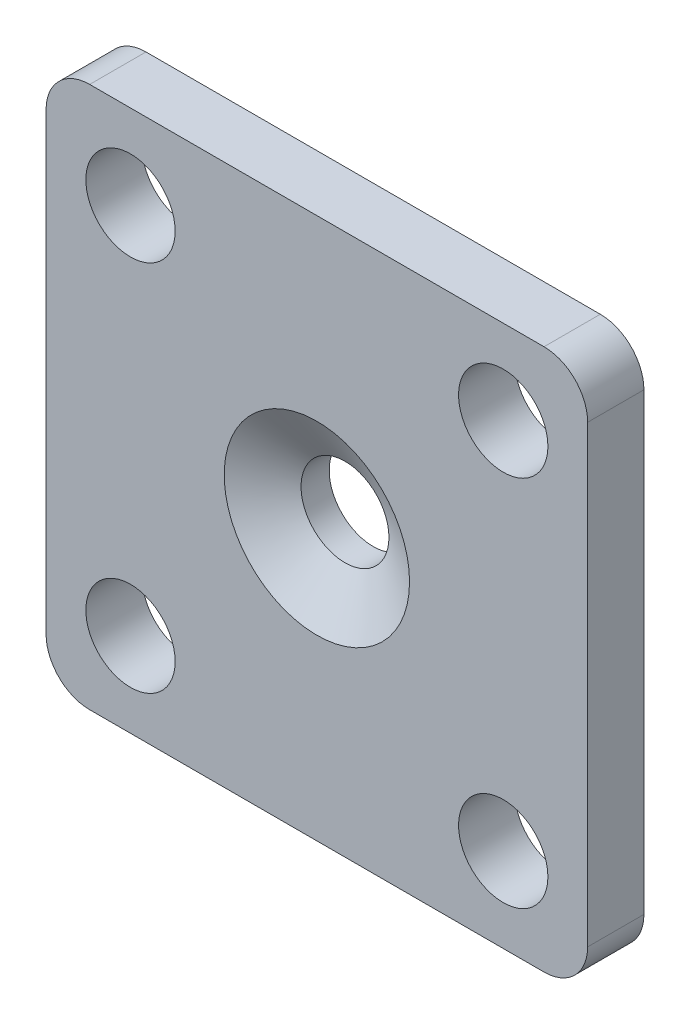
ISO-10303-21;
HEADER;
FILE_DESCRIPTION(('STEP AP214'),'2;1');
FILE_NAME('part.step','',(''),(''),'','','');
FILE_SCHEMA(('AUTOMOTIVE_DESIGN { 1 0 10303 214 1 1 1 1 }'));
ENDSEC;
DATA;
#1=APPLICATION_CONTEXT('core data for automotive mechanical design processes');
#2=APPLICATION_PROTOCOL_DEFINITION('international standard','automotive_design',2000,#1);
#3=PRODUCT_CONTEXT('',#1,'mechanical');
#4=PRODUCT('Part','Part','',(#3));
#5=PRODUCT_RELATED_PRODUCT_CATEGORY('part','',(#4));
#6=PRODUCT_DEFINITION_FORMATION('','',#4);
#7=PRODUCT_DEFINITION_CONTEXT('part definition',#1,'design');
#8=PRODUCT_DEFINITION('design','',#6,#7);
#9=PRODUCT_DEFINITION_SHAPE('','',#8);
#10=(LENGTH_UNIT() NAMED_UNIT(*) SI_UNIT(.MILLI.,.METRE.));
#11=(NAMED_UNIT(*) PLANE_ANGLE_UNIT() SI_UNIT($,.RADIAN.));
#12=(NAMED_UNIT(*) SI_UNIT($,.STERADIAN.) SOLID_ANGLE_UNIT());
#13=UNCERTAINTY_MEASURE_WITH_UNIT(LENGTH_MEASURE(1.E-05),#10,'distance_accuracy_value','');
#14=(GEOMETRIC_REPRESENTATION_CONTEXT(3) GLOBAL_UNCERTAINTY_ASSIGNED_CONTEXT((#13)) GLOBAL_UNIT_ASSIGNED_CONTEXT((#10,
#11,#12)) REPRESENTATION_CONTEXT('',''));
#15=CARTESIAN_POINT('',(0.,0.,0.));
#16=DIRECTION('',(0.,0.,1.));
#17=DIRECTION('',(1.,0.,0.));
#18=AXIS2_PLACEMENT_3D('',#15,#16,#17);
#19=CARTESIAN_POINT('',(4.8895,-4.8895,0.));
#20=DIRECTION('',(0.,0.,1.));
#21=DIRECTION('',(1.,0.,0.));
#22=AXIS2_PLACEMENT_3D('',#19,#20,#21);
#23=PLANE('',#22);
#24=CARTESIAN_POINT('',(0.,0.,0.));
#25=DIRECTION('',(0.,0.,-1.));
#26=DIRECTION('',(-1.,0.,0.));
#27=AXIS2_PLACEMENT_3D('',#24,#25,#26);
#28=CIRCLE('',#27,1.6002);
#29=CARTESIAN_POINT('',(-1.6002,0.,0.));
#30=VERTEX_POINT('',#29);
#31=EDGE_CURVE('E218',#30,#30,#28,.T.);
#32=ORIENTED_EDGE('',*,*,#31,.F.);
#33=EDGE_LOOP('',(#32));
#34=FACE_BOUND('',#33,.T.);
#35=CARTESIAN_POINT('',(0.,0.,0.));
#36=DIRECTION('',(0.,0.,-1.));
#37=DIRECTION('',(-1.,0.,0.));
#38=AXIS2_PLACEMENT_3D('',#35,#36,#37);
#39=CIRCLE('',#38,3.1496);
#40=CARTESIAN_POINT('',(-3.1496,0.,0.));
#41=VERTEX_POINT('',#40);
#42=EDGE_CURVE('E234',#41,#41,#39,.T.);
#43=ORIENTED_EDGE('',*,*,#42,.T.);
#44=EDGE_LOOP('',(#43));
#45=FACE_BOUND('',#44,.T.);
#46=ADVANCED_FACE('F41',(#34,#45),#23,.F.);
#47=CARTESIAN_POINT('',(0.,0.,0.));
#48=DIRECTION('',(0.,0.,1.));
#49=DIRECTION('',(1.,0.,0.));
#50=AXIS2_PLACEMENT_3D('',#47,#48,#49);
#51=CIRCLE('',#50,0.793749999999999);
#52=CARTESIAN_POINT('',(0.793750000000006,0.,0.));
#53=VERTEX_POINT('',#52);
#54=EDGE_CURVE('E135',#53,#53,#51,.T.);
#55=ORIENTED_EDGE('',*,*,#54,.T.);
#56=EDGE_LOOP('',(#55));
#57=FACE_BOUND('',#56,.T.);
#58=CARTESIAN_POINT('',(0.,0.,0.));
#59=DIRECTION('',(0.,0.,-1.));
#60=DIRECTION('',(-1.,0.,0.));
#61=AXIS2_PLACEMENT_3D('',#58,#59,#60);
#62=CIRCLE('',#61,0.9398);
#63=CARTESIAN_POINT('',(-0.9398,0.,0.));
#64=VERTEX_POINT('',#63);
#65=EDGE_CURVE('E222',#64,#64,#62,.T.);
#66=ORIENTED_EDGE('',*,*,#65,.T.);
#67=EDGE_LOOP('',(#66));
#68=FACE_BOUND('',#67,.T.);
#69=ADVANCED_FACE('F261',(#57,#68),#23,.F.);
#70=CARTESIAN_POINT('',(4.8895,-4.8895,1.016));
#71=DIRECTION('',(0.,0.,1.));
#72=DIRECTION('',(1.,0.,0.));
#73=AXIS2_PLACEMENT_3D('',#70,#71,#72);
#74=PLANE('',#73);
#75=CARTESIAN_POINT('',(0.,0.,1.016));
#76=DIRECTION('',(0.,0.,1.));
#77=DIRECTION('',(1.,0.,0.));
#78=AXIS2_PLACEMENT_3D('',#75,#76,#77);
#79=CIRCLE('',#78,1.67363181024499);
#80=CARTESIAN_POINT('',(1.673631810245,0.,1.016));
#81=VERTEX_POINT('',#80);
#82=EDGE_CURVE('E153',#81,#81,#79,.F.);
#83=ORIENTED_EDGE('',*,*,#82,.T.);
#84=EDGE_LOOP('',(#83));
#85=FACE_BOUND('',#84,.T.);
#86=CARTESIAN_POINT('',(3.36549999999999,-3.36549999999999,1.016));
#87=DIRECTION('',(0.,0.,1.));
#88=DIRECTION('',(1.,0.,0.));
#89=AXIS2_PLACEMENT_3D('',#86,#87,#88);
#90=CIRCLE('',#89,0.80645);
#91=CARTESIAN_POINT('',(4.17194999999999,-3.36549999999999,1.016));
#92=VERTEX_POINT('',#91);
#93=EDGE_CURVE('E203',#92,#92,#90,.T.);
#94=ORIENTED_EDGE('',*,*,#93,.F.);
#95=EDGE_LOOP('',(#94));
#96=FACE_BOUND('',#95,.T.);
#97=CARTESIAN_POINT('',(-3.36550000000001,3.36550000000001,1.016));
#98=DIRECTION('',(0.,0.,1.));
#99=DIRECTION('',(1.,0.,0.));
#100=AXIS2_PLACEMENT_3D('',#97,#98,#99);
#101=CIRCLE('',#100,0.806450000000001);
#102=CARTESIAN_POINT('',(-2.55905000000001,3.36550000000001,1.016));
#103=VERTEX_POINT('',#102);
#104=EDGE_CURVE('E141',#103,#103,#101,.T.);
#105=ORIENTED_EDGE('',*,*,#104,.F.);
#106=EDGE_LOOP('',(#105));
#107=FACE_BOUND('',#106,.T.);
#108=DIRECTION('',(1.,0.,0.));
#109=VECTOR('',#108,1.);
#110=CARTESIAN_POINT('',(-4.8895,-4.8895,1.016));
#111=LINE('',#110,#109);
#112=CARTESIAN_POINT('',(-4.1021,-4.8895,1.016));
#113=VERTEX_POINT('',#112);
#114=CARTESIAN_POINT('',(4.1021,-4.8895,1.016));
#115=VERTEX_POINT('',#114);
#116=EDGE_CURVE('E144',#113,#115,#111,.T.);
#117=ORIENTED_EDGE('',*,*,#116,.T.);
#118=CARTESIAN_POINT('',(4.1021,-4.1021,1.016));
#119=DIRECTION('',(0.,0.,1.));
#120=DIRECTION('',(1.,0.,0.));
#121=AXIS2_PLACEMENT_3D('',#118,#119,#120);
#122=CIRCLE('',#121,0.7874);
#123=CARTESIAN_POINT('',(4.8895,-4.1021,1.016));
#124=VERTEX_POINT('',#123);
#125=EDGE_CURVE('E169',#115,#124,#122,.T.);
#126=ORIENTED_EDGE('',*,*,#125,.T.);
#127=DIRECTION('',(0.,1.,0.));
#128=VECTOR('',#127,1.);
#129=CARTESIAN_POINT('',(4.8895,4.8895,1.016));
#130=LINE('',#129,#128);
#131=CARTESIAN_POINT('',(4.8895,4.1021,1.016));
#132=VERTEX_POINT('',#131);
#133=EDGE_CURVE('E127',#124,#132,#130,.T.);
#134=ORIENTED_EDGE('',*,*,#133,.T.);
#135=CARTESIAN_POINT('',(4.1021,4.1021,1.016));
#136=DIRECTION('',(0.,0.,1.));
#137=DIRECTION('',(1.,0.,0.));
#138=AXIS2_PLACEMENT_3D('',#135,#136,#137);
#139=CIRCLE('',#138,0.7874);
#140=CARTESIAN_POINT('',(4.1021,4.8895,1.016));
#141=VERTEX_POINT('',#140);
#142=EDGE_CURVE('E164',#132,#141,#139,.T.);
#143=ORIENTED_EDGE('',*,*,#142,.T.);
#144=DIRECTION('',(-1.,0.,0.));
#145=VECTOR('',#144,1.);
#146=CARTESIAN_POINT('',(-4.8895,4.8895,1.016));
#147=LINE('',#146,#145);
#148=CARTESIAN_POINT('',(-4.1021,4.8895,1.016));
#149=VERTEX_POINT('',#148);
#150=EDGE_CURVE('E180',#141,#149,#147,.T.);
#151=ORIENTED_EDGE('',*,*,#150,.T.);
#152=CARTESIAN_POINT('',(-4.1021,4.1021,1.016));
#153=DIRECTION('',(0.,0.,1.));
#154=DIRECTION('',(1.,0.,0.));
#155=AXIS2_PLACEMENT_3D('',#152,#153,#154);
#156=CIRCLE('',#155,0.7874);
#157=CARTESIAN_POINT('',(-4.8895,4.1021,1.016));
#158=VERTEX_POINT('',#157);
#159=EDGE_CURVE('E63',#149,#158,#156,.T.);
#160=ORIENTED_EDGE('',*,*,#159,.T.);
#161=DIRECTION('',(0.,-1.,0.));
#162=VECTOR('',#161,1.);
#163=CARTESIAN_POINT('',(-4.8895,4.8895,1.016));
#164=LINE('',#163,#162);
#165=CARTESIAN_POINT('',(-4.8895,-4.1021,1.016));
#166=VERTEX_POINT('',#165);
#167=EDGE_CURVE('E188',#158,#166,#164,.T.);
#168=ORIENTED_EDGE('',*,*,#167,.T.);
#169=CARTESIAN_POINT('',(-4.1021,-4.1021,1.016));
#170=DIRECTION('',(0.,0.,1.));
#171=DIRECTION('',(1.,0.,0.));
#172=AXIS2_PLACEMENT_3D('',#169,#170,#171);
#173=CIRCLE('',#172,0.7874);
#174=EDGE_CURVE('E167',#166,#113,#173,.T.);
#175=ORIENTED_EDGE('',*,*,#174,.T.);
#176=EDGE_LOOP('',(#117,#126,#134,#143,#151,#160,#168,#175));
#177=FACE_BOUND('',#176,.T.);
#178=CARTESIAN_POINT('',(3.36549999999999,3.36550000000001,1.016));
#179=DIRECTION('',(0.,0.,1.));
#180=DIRECTION('',(1.,0.,0.));
#181=AXIS2_PLACEMENT_3D('',#178,#179,#180);
#182=CIRCLE('',#181,0.80645);
#183=CARTESIAN_POINT('',(4.17194999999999,3.36550000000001,1.016));
#184=VERTEX_POINT('',#183);
#185=EDGE_CURVE('E197',#184,#184,#182,.T.);
#186=ORIENTED_EDGE('',*,*,#185,.F.);
#187=EDGE_LOOP('',(#186));
#188=FACE_BOUND('',#187,.T.);
#189=CARTESIAN_POINT('',(-3.36550000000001,-3.36549999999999,1.016));
#190=DIRECTION('',(0.,0.,1.));
#191=DIRECTION('',(1.,0.,0.));
#192=AXIS2_PLACEMENT_3D('',#189,#190,#191);
#193=CIRCLE('',#192,0.806450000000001);
#194=CARTESIAN_POINT('',(-2.55905000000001,-3.36549999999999,1.016));
#195=VERTEX_POINT('',#194);
#196=EDGE_CURVE('E209',#195,#195,#193,.T.);
#197=ORIENTED_EDGE('',*,*,#196,.F.);
#198=EDGE_LOOP('',(#197));
#199=FACE_BOUND('',#198,.T.);
#200=ADVANCED_FACE('F259',(#85,#96,#107,#177,#188,#199),#74,.T.);
#201=CARTESIAN_POINT('',(0.,0.,0.));
#202=DIRECTION('',(0.,0.,-1.));
#203=DIRECTION('',(-1.,0.,0.));
#204=AXIS2_PLACEMENT_3D('',#201,#202,#203);
#205=CIRCLE('',#204,3.7846);
#206=CARTESIAN_POINT('',(-3.7846,0.,0.));
#207=VERTEX_POINT('',#206);
#208=EDGE_CURVE('E230',#207,#207,#205,.T.);
#209=ORIENTED_EDGE('',*,*,#208,.F.);
#210=EDGE_LOOP('',(#209));
#211=FACE_BOUND('',#210,.T.);
#212=CARTESIAN_POINT('',(3.36549999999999,-3.36549999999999,0.));
#213=DIRECTION('',(0.,0.,1.));
#214=DIRECTION('',(1.,0.,0.));
#215=AXIS2_PLACEMENT_3D('',#212,#213,#214);
#216=CIRCLE('',#215,0.80645);
#217=CARTESIAN_POINT('',(4.17194999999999,-3.36549999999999,0.));
#218=VERTEX_POINT('',#217);
#219=EDGE_CURVE('E206',#218,#218,#216,.T.);
#220=ORIENTED_EDGE('',*,*,#219,.T.);
#221=EDGE_LOOP('',(#220));
#222=FACE_BOUND('',#221,.T.);
#223=CARTESIAN_POINT('',(-3.36550000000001,3.36550000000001,0.));
#224=DIRECTION('',(0.,0.,1.));
#225=DIRECTION('',(1.,0.,0.));
#226=AXIS2_PLACEMENT_3D('',#223,#224,#225);
#227=CIRCLE('',#226,0.806450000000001);
#228=CARTESIAN_POINT('',(-2.55905000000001,3.36550000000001,0.));
#229=VERTEX_POINT('',#228);
#230=EDGE_CURVE('E194',#229,#229,#227,.T.);
#231=ORIENTED_EDGE('',*,*,#230,.T.);
#232=EDGE_LOOP('',(#231));
#233=FACE_BOUND('',#232,.T.);
#234=DIRECTION('',(0.,1.,0.));
#235=VECTOR('',#234,1.);
#236=CARTESIAN_POINT('',(4.8895,4.8895,0.));
#237=LINE('',#236,#235);
#238=CARTESIAN_POINT('',(4.8895,-4.1021,0.));
#239=VERTEX_POINT('',#238);
#240=CARTESIAN_POINT('',(4.8895,4.1021,0.));
#241=VERTEX_POINT('',#240);
#242=EDGE_CURVE('E124',#239,#241,#237,.T.);
#243=ORIENTED_EDGE('',*,*,#242,.F.);
#244=CARTESIAN_POINT('',(4.1021,-4.1021,0.));
#245=DIRECTION('',(0.,0.,1.));
#246=DIRECTION('',(1.,0.,0.));
#247=AXIS2_PLACEMENT_3D('',#244,#245,#246);
#248=CIRCLE('',#247,0.7874);
#249=CARTESIAN_POINT('',(4.1021,-4.8895,0.));
#250=VERTEX_POINT('',#249);
#251=EDGE_CURVE('E107',#239,#250,#248,.F.);
#252=ORIENTED_EDGE('',*,*,#251,.T.);
#253=DIRECTION('',(1.,0.,0.));
#254=VECTOR('',#253,1.);
#255=CARTESIAN_POINT('',(-4.8895,-4.8895,0.));
#256=LINE('',#255,#254);
#257=CARTESIAN_POINT('',(-4.1021,-4.8895,0.));
#258=VERTEX_POINT('',#257);
#259=EDGE_CURVE('E148',#258,#250,#256,.T.);
#260=ORIENTED_EDGE('',*,*,#259,.F.);
#261=CARTESIAN_POINT('',(-4.1021,-4.1021,0.));
#262=DIRECTION('',(0.,0.,1.));
#263=DIRECTION('',(1.,0.,0.));
#264=AXIS2_PLACEMENT_3D('',#261,#262,#263);
#265=CIRCLE('',#264,0.7874);
#266=CARTESIAN_POINT('',(-4.8895,-4.1021,0.));
#267=VERTEX_POINT('',#266);
#268=EDGE_CURVE('E118',#258,#267,#265,.F.);
#269=ORIENTED_EDGE('',*,*,#268,.T.);
#270=DIRECTION('',(0.,-1.,0.));
#271=VECTOR('',#270,1.);
#272=CARTESIAN_POINT('',(-4.8895,4.8895,0.));
#273=LINE('',#272,#271);
#274=CARTESIAN_POINT('',(-4.8895,4.1021,0.));
#275=VERTEX_POINT('',#274);
#276=EDGE_CURVE('E138',#275,#267,#273,.T.);
#277=ORIENTED_EDGE('',*,*,#276,.F.);
#278=CARTESIAN_POINT('',(-4.1021,4.1021,0.));
#279=DIRECTION('',(0.,0.,1.));
#280=DIRECTION('',(1.,0.,0.));
#281=AXIS2_PLACEMENT_3D('',#278,#279,#280);
#282=CIRCLE('',#281,0.7874);
#283=CARTESIAN_POINT('',(-4.1021,4.8895,0.));
#284=VERTEX_POINT('',#283);
#285=EDGE_CURVE('E158',#275,#284,#282,.F.);
#286=ORIENTED_EDGE('',*,*,#285,.T.);
#287=DIRECTION('',(-1.,0.,0.));
#288=VECTOR('',#287,1.);
#289=CARTESIAN_POINT('',(-4.8895,4.8895,0.));
#290=LINE('',#289,#288);
#291=CARTESIAN_POINT('',(4.1021,4.8895,0.));
#292=VERTEX_POINT('',#291);
#293=EDGE_CURVE('E134',#292,#284,#290,.T.);
#294=ORIENTED_EDGE('',*,*,#293,.F.);
#295=CARTESIAN_POINT('',(4.1021,4.1021,0.));
#296=DIRECTION('',(0.,0.,1.));
#297=DIRECTION('',(1.,0.,0.));
#298=AXIS2_PLACEMENT_3D('',#295,#296,#297);
#299=CIRCLE('',#298,0.7874);
#300=EDGE_CURVE('E128',#292,#241,#299,.F.);
#301=ORIENTED_EDGE('',*,*,#300,.T.);
#302=EDGE_LOOP('',(#243,#252,#260,#269,#277,#286,#294,#301));
#303=FACE_BOUND('',#302,.T.);
#304=CARTESIAN_POINT('',(3.36549999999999,3.36550000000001,0.));
#305=DIRECTION('',(0.,0.,1.));
#306=DIRECTION('',(1.,0.,0.));
#307=AXIS2_PLACEMENT_3D('',#304,#305,#306);
#308=CIRCLE('',#307,0.80645);
#309=CARTESIAN_POINT('',(4.17194999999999,3.36550000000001,0.));
#310=VERTEX_POINT('',#309);
#311=EDGE_CURVE('E200',#310,#310,#308,.T.);
#312=ORIENTED_EDGE('',*,*,#311,.T.);
#313=EDGE_LOOP('',(#312));
#314=FACE_BOUND('',#313,.T.);
#315=CARTESIAN_POINT('',(-3.36550000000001,-3.36549999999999,0.));
#316=DIRECTION('',(0.,0.,1.));
#317=DIRECTION('',(1.,0.,0.));
#318=AXIS2_PLACEMENT_3D('',#315,#316,#317);
#319=CIRCLE('',#318,0.806450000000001);
#320=CARTESIAN_POINT('',(-2.55905000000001,-3.36549999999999,0.));
#321=VERTEX_POINT('',#320);
#322=EDGE_CURVE('E212',#321,#321,#319,.T.);
#323=ORIENTED_EDGE('',*,*,#322,.T.);
#324=EDGE_LOOP('',(#323));
#325=FACE_BOUND('',#324,.T.);
#326=ADVANCED_FACE('F131',(#211,#222,#233,#303,#314,#325),#23,.F.);
#327=CARTESIAN_POINT('',(4.8895,4.8895,1.016));
#328=DIRECTION('',(-1.,0.,0.));
#329=DIRECTION('',(0.,-1.,0.));
#330=AXIS2_PLACEMENT_3D('',#327,#328,#329);
#331=PLANE('',#330);
#332=ORIENTED_EDGE('',*,*,#133,.F.);
#333=DIRECTION('',(0.,0.,-1.));
#334=VECTOR('',#333,1.);
#335=CARTESIAN_POINT('',(4.8895,-4.1021,1.016));
#336=LINE('',#335,#334);
#337=EDGE_CURVE('E111',#124,#239,#336,.T.);
#338=ORIENTED_EDGE('',*,*,#337,.T.);
#339=ORIENTED_EDGE('',*,*,#242,.T.);
#340=DIRECTION('',(0.,0.,-1.));
#341=VECTOR('',#340,1.);
#342=CARTESIAN_POINT('',(4.8895,4.1021,1.016));
#343=LINE('',#342,#341);
#344=EDGE_CURVE('E129',#241,#132,#343,.F.);
#345=ORIENTED_EDGE('',*,*,#344,.T.);
#346=EDGE_LOOP('',(#332,#338,#339,#345));
#347=FACE_BOUND('',#346,.T.);
#348=ADVANCED_FACE('F123',(#347),#331,.F.);
#349=CARTESIAN_POINT('',(-4.8895,4.8895,1.016));
#350=DIRECTION('',(0.,-1.,0.));
#351=DIRECTION('',(0.,0.,-1.));
#352=AXIS2_PLACEMENT_3D('',#349,#350,#351);
#353=PLANE('',#352);
#354=ORIENTED_EDGE('',*,*,#293,.T.);
#355=DIRECTION('',(0.,0.,-1.));
#356=VECTOR('',#355,1.);
#357=CARTESIAN_POINT('',(-4.1021,4.8895,1.016));
#358=LINE('',#357,#356);
#359=EDGE_CURVE('E12',#284,#149,#358,.F.);
#360=ORIENTED_EDGE('',*,*,#359,.T.);
#361=ORIENTED_EDGE('',*,*,#150,.F.);
#362=DIRECTION('',(0.,0.,-1.));
#363=VECTOR('',#362,1.);
#364=CARTESIAN_POINT('',(4.1021,4.8895,1.016));
#365=LINE('',#364,#363);
#366=EDGE_CURVE('E49',#141,#292,#365,.T.);
#367=ORIENTED_EDGE('',*,*,#366,.T.);
#368=EDGE_LOOP('',(#354,#360,#361,#367));
#369=FACE_BOUND('',#368,.T.);
#370=ADVANCED_FACE('F178',(#369),#353,.F.);
#371=CARTESIAN_POINT('',(-4.8895,4.8895,1.016));
#372=DIRECTION('',(1.,0.,0.));
#373=DIRECTION('',(0.,1.,0.));
#374=AXIS2_PLACEMENT_3D('',#371,#372,#373);
#375=PLANE('',#374);
#376=ORIENTED_EDGE('',*,*,#276,.T.);
#377=DIRECTION('',(0.,0.,-1.));
#378=VECTOR('',#377,1.);
#379=CARTESIAN_POINT('',(-4.8895,-4.1021,1.016));
#380=LINE('',#379,#378);
#381=EDGE_CURVE('E56',#267,#166,#380,.F.);
#382=ORIENTED_EDGE('',*,*,#381,.T.);
#383=ORIENTED_EDGE('',*,*,#167,.F.);
#384=DIRECTION('',(0.,0.,-1.));
#385=VECTOR('',#384,1.);
#386=CARTESIAN_POINT('',(-4.8895,4.1021,1.016));
#387=LINE('',#386,#385);
#388=EDGE_CURVE('E171',#158,#275,#387,.T.);
#389=ORIENTED_EDGE('',*,*,#388,.T.);
#390=EDGE_LOOP('',(#376,#382,#383,#389));
#391=FACE_BOUND('',#390,.T.);
#392=ADVANCED_FACE('F187',(#391),#375,.F.);
#393=CARTESIAN_POINT('',(-4.8895,-4.8895,1.016));
#394=DIRECTION('',(0.,1.,0.));
#395=DIRECTION('',(0.,0.,1.));
#396=AXIS2_PLACEMENT_3D('',#393,#394,#395);
#397=PLANE('',#396);
#398=ORIENTED_EDGE('',*,*,#259,.T.);
#399=DIRECTION('',(0.,0.,-1.));
#400=VECTOR('',#399,1.);
#401=CARTESIAN_POINT('',(4.1021,-4.8895,1.016));
#402=LINE('',#401,#400);
#403=EDGE_CURVE('E112',#250,#115,#402,.F.);
#404=ORIENTED_EDGE('',*,*,#403,.T.);
#405=ORIENTED_EDGE('',*,*,#116,.F.);
#406=DIRECTION('',(0.,0.,-1.));
#407=VECTOR('',#406,1.);
#408=CARTESIAN_POINT('',(-4.1021,-4.8895,1.016));
#409=LINE('',#408,#407);
#410=EDGE_CURVE('E117',#113,#258,#409,.T.);
#411=ORIENTED_EDGE('',*,*,#410,.T.);
#412=EDGE_LOOP('',(#398,#404,#405,#411));
#413=FACE_BOUND('',#412,.T.);
#414=ADVANCED_FACE('F279',(#413),#397,.F.);
#415=CARTESIAN_POINT('',(0.,0.,1.016));
#416=DIRECTION('',(0.,0.,-1.));
#417=DIRECTION('',(-1.,0.,0.));
#418=AXIS2_PLACEMENT_3D('',#415,#416,#417);
#419=CYLINDRICAL_SURFACE('',#418,0.793749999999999);
#420=CARTESIAN_POINT('',(0.,0.,0.507999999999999));
#421=DIRECTION('',(0.,0.,1.));
#422=DIRECTION('',(1.,0.,0.));
#423=AXIS2_PLACEMENT_3D('',#420,#421,#422);
#424=CIRCLE('',#423,0.793749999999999);
#425=CARTESIAN_POINT('',(0.793750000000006,0.,0.507999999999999));
#426=VERTEX_POINT('',#425);
#427=EDGE_CURVE('E150',#426,#426,#424,.T.);
#428=ORIENTED_EDGE('',*,*,#427,.T.);
#429=EDGE_LOOP('',(#428));
#430=FACE_BOUND('',#429,.T.);
#431=ORIENTED_EDGE('',*,*,#54,.F.);
#432=EDGE_LOOP('',(#431));
#433=FACE_BOUND('',#432,.T.);
#434=ADVANCED_FACE('F269',(#430,#433),#419,.F.);
#435=CARTESIAN_POINT('',(-3.36550000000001,3.36550000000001,1.016));
#436=DIRECTION('',(0.,0.,-1.));
#437=DIRECTION('',(-1.,0.,0.));
#438=AXIS2_PLACEMENT_3D('',#435,#436,#437);
#439=CYLINDRICAL_SURFACE('',#438,0.806450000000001);
#440=ORIENTED_EDGE('',*,*,#104,.T.);
#441=EDGE_LOOP('',(#440));
#442=FACE_BOUND('',#441,.T.);
#443=ORIENTED_EDGE('',*,*,#230,.F.);
#444=EDGE_LOOP('',(#443));
#445=FACE_BOUND('',#444,.T.);
#446=ADVANCED_FACE('F266',(#442,#445),#439,.F.);
#447=CARTESIAN_POINT('',(3.36549999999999,3.36550000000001,1.016));
#448=DIRECTION('',(0.,0.,-1.));
#449=DIRECTION('',(-1.,0.,0.));
#450=AXIS2_PLACEMENT_3D('',#447,#448,#449);
#451=CYLINDRICAL_SURFACE('',#450,0.80645);
#452=ORIENTED_EDGE('',*,*,#185,.T.);
#453=EDGE_LOOP('',(#452));
#454=FACE_BOUND('',#453,.T.);
#455=ORIENTED_EDGE('',*,*,#311,.F.);
#456=EDGE_LOOP('',(#455));
#457=FACE_BOUND('',#456,.T.);
#458=ADVANCED_FACE('F268',(#454,#457),#451,.F.);
#459=CARTESIAN_POINT('',(3.36549999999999,-3.36549999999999,1.016));
#460=DIRECTION('',(0.,0.,-1.));
#461=DIRECTION('',(-1.,0.,0.));
#462=AXIS2_PLACEMENT_3D('',#459,#460,#461);
#463=CYLINDRICAL_SURFACE('',#462,0.80645);
#464=ORIENTED_EDGE('',*,*,#93,.T.);
#465=EDGE_LOOP('',(#464));
#466=FACE_BOUND('',#465,.T.);
#467=ORIENTED_EDGE('',*,*,#219,.F.);
#468=EDGE_LOOP('',(#467));
#469=FACE_BOUND('',#468,.T.);
#470=ADVANCED_FACE('F276',(#466,#469),#463,.F.);
#471=CARTESIAN_POINT('',(-3.36550000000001,-3.36549999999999,1.016));
#472=DIRECTION('',(0.,0.,-1.));
#473=DIRECTION('',(-1.,0.,0.));
#474=AXIS2_PLACEMENT_3D('',#471,#472,#473);
#475=CYLINDRICAL_SURFACE('',#474,0.806450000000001);
#476=ORIENTED_EDGE('',*,*,#196,.T.);
#477=EDGE_LOOP('',(#476));
#478=FACE_BOUND('',#477,.T.);
#479=ORIENTED_EDGE('',*,*,#322,.F.);
#480=EDGE_LOOP('',(#479));
#481=FACE_BOUND('',#480,.T.);
#482=ADVANCED_FACE('F305',(#478,#481),#475,.F.);
#483=CARTESIAN_POINT('',(0.,0.,0.507999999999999));
#484=DIRECTION('',(0.,0.,1.));
#485=DIRECTION('',(1.,0.,0.));
#486=AXIS2_PLACEMENT_3D('',#483,#484,#485);
#487=CONICAL_SURFACE('',#486,0.793749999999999,1.0471975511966);
#488=ORIENTED_EDGE('',*,*,#82,.F.);
#489=EDGE_LOOP('',(#488));
#490=FACE_BOUND('',#489,.T.);
#491=ORIENTED_EDGE('',*,*,#427,.F.);
#492=EDGE_LOOP('',(#491));
#493=FACE_BOUND('',#492,.T.);
#494=ADVANCED_FACE('F301',(#490,#493),#487,.F.);
#495=CARTESIAN_POINT('',(0.,0.,0.381));
#496=DIRECTION('',(0.,0.,-1.));
#497=DIRECTION('',(-1.,0.,0.));
#498=AXIS2_PLACEMENT_3D('',#495,#496,#497);
#499=CYLINDRICAL_SURFACE('',#498,0.9398);
#500=CARTESIAN_POINT('',(0.,0.,0.381));
#501=DIRECTION('',(0.,0.,-1.));
#502=DIRECTION('',(-1.,0.,0.));
#503=AXIS2_PLACEMENT_3D('',#500,#501,#502);
#504=CIRCLE('',#503,0.9398);
#505=CARTESIAN_POINT('',(-0.9398,0.,0.381));
#506=VERTEX_POINT('',#505);
#507=EDGE_CURVE('E221',#506,#506,#504,.T.);
#508=CARTESIAN_POINT('',(-0.9398,0.,0.381));
#509=CARTESIAN_POINT('',(-0.9398,0.,0.37703125));
#510=CARTESIAN_POINT('',(-0.9398,0.,0.3730625));
#511=CARTESIAN_POINT('',(-0.9398,0.,0.365125));
#512=CARTESIAN_POINT('',(-0.9398,0.,0.36115625));
#513=CARTESIAN_POINT('',(-0.9398,0.,0.35321875));
#514=CARTESIAN_POINT('',(-0.9398,0.,0.34925));
#515=CARTESIAN_POINT('',(-0.9398,0.,0.3413125));
#516=CARTESIAN_POINT('',(-0.9398,0.,0.33734375));
#517=CARTESIAN_POINT('',(-0.9398,0.,0.32940625));
#518=CARTESIAN_POINT('',(-0.9398,0.,0.3254375));
#519=CARTESIAN_POINT('',(-0.9398,0.,0.3175));
#520=CARTESIAN_POINT('',(-0.9398,0.,0.31353125));
#521=CARTESIAN_POINT('',(-0.9398,0.,0.30559375));
#522=CARTESIAN_POINT('',(-0.9398,0.,0.301625));
#523=CARTESIAN_POINT('',(-0.9398,0.,0.2936875));
#524=CARTESIAN_POINT('',(-0.9398,0.,0.28971875));
#525=CARTESIAN_POINT('',(-0.9398,0.,0.28178125));
#526=CARTESIAN_POINT('',(-0.9398,0.,0.2778125));
#527=CARTESIAN_POINT('',(-0.9398,0.,0.269875));
#528=CARTESIAN_POINT('',(-0.9398,0.,0.26590625));
#529=CARTESIAN_POINT('',(-0.9398,0.,0.25796875));
#530=CARTESIAN_POINT('',(-0.9398,0.,0.254));
#531=CARTESIAN_POINT('',(-0.9398,0.,0.2460625));
#532=CARTESIAN_POINT('',(-0.9398,0.,0.24209375));
#533=CARTESIAN_POINT('',(-0.9398,0.,0.23415625));
#534=CARTESIAN_POINT('',(-0.9398,0.,0.2301875));
#535=CARTESIAN_POINT('',(-0.9398,0.,0.22225));
#536=CARTESIAN_POINT('',(-0.9398,0.,0.21828125));
#537=CARTESIAN_POINT('',(-0.9398,0.,0.21034375));
#538=CARTESIAN_POINT('',(-0.9398,0.,0.206375));
#539=CARTESIAN_POINT('',(-0.9398,0.,0.1984375));
#540=CARTESIAN_POINT('',(-0.9398,0.,0.19446875));
#541=CARTESIAN_POINT('',(-0.9398,0.,0.18653125));
#542=CARTESIAN_POINT('',(-0.9398,0.,0.1825625));
#543=CARTESIAN_POINT('',(-0.9398,0.,0.174625));
#544=CARTESIAN_POINT('',(-0.9398,0.,0.17065625));
#545=CARTESIAN_POINT('',(-0.9398,0.,0.16271875));
#546=CARTESIAN_POINT('',(-0.9398,0.,0.15875));
#547=CARTESIAN_POINT('',(-0.9398,0.,0.1508125));
#548=CARTESIAN_POINT('',(-0.9398,0.,0.14684375));
#549=CARTESIAN_POINT('',(-0.9398,0.,0.13890625));
#550=CARTESIAN_POINT('',(-0.9398,0.,0.1349375));
#551=CARTESIAN_POINT('',(-0.9398,0.,0.127));
#552=CARTESIAN_POINT('',(-0.9398,0.,0.12303125));
#553=CARTESIAN_POINT('',(-0.9398,0.,0.11509375));
#554=CARTESIAN_POINT('',(-0.9398,0.,0.111125));
#555=CARTESIAN_POINT('',(-0.9398,0.,0.1031875));
#556=CARTESIAN_POINT('',(-0.9398,0.,0.09921875));
#557=CARTESIAN_POINT('',(-0.9398,0.,0.09128125));
#558=CARTESIAN_POINT('',(-0.9398,0.,0.0873125));
#559=CARTESIAN_POINT('',(-0.9398,0.,0.079375));
#560=CARTESIAN_POINT('',(-0.9398,0.,0.07540625));
#561=CARTESIAN_POINT('',(-0.9398,0.,0.06746875));
#562=CARTESIAN_POINT('',(-0.9398,0.,0.0635));
#563=CARTESIAN_POINT('',(-0.9398,0.,0.0555625));
#564=CARTESIAN_POINT('',(-0.9398,0.,0.05159375));
#565=CARTESIAN_POINT('',(-0.9398,0.,0.04365625));
#566=CARTESIAN_POINT('',(-0.9398,0.,0.0396875));
#567=CARTESIAN_POINT('',(-0.9398,0.,0.03175));
#568=CARTESIAN_POINT('',(-0.9398,0.,0.02778125));
#569=CARTESIAN_POINT('',(-0.9398,0.,0.01984375));
#570=CARTESIAN_POINT('',(-0.9398,0.,0.015875));
#571=CARTESIAN_POINT('',(-0.9398,0.,0.00793749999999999));
#572=CARTESIAN_POINT('',(-0.9398,0.,0.00396874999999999));
#573=CARTESIAN_POINT('',(-0.9398,0.,0.));
#574=B_SPLINE_CURVE_WITH_KNOTS('',3,(#508,#509,#510,#511,#512,#513,#514,#515,#516,#517,#518,
#519,#520,#521,#522,#523,#524,#525,#526,#527,#528,#529,#530,#531,#532,#533,#534,#535,#536,#537,
#538,#539,#540,#541,#542,#543,#544,#545,#546,#547,#548,#549,#550,#551,#552,#553,#554,#555,#556,
#557,#558,#559,#560,#561,#562,#563,#564,#565,#566,#567,#568,#569,#570,#571,#572,#573),
.UNSPECIFIED.,.F.,.F.,(4,2,2,2,2,2,2,2,2,2,2,2,2,2,2,2,2,2,2,2,2,2,2,2,2,2,2,2,2,2,2,2,4),(0.,
0.01190625,0.0238125,0.03571875,0.047625,0.05953125,0.0714375,0.08334375,0.0952500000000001,
0.10715625,0.1190625,0.13096875,0.142875,0.15478125,0.1666875,0.17859375,0.1905,0.20240625,
0.2143125,0.22621875,0.238125,0.25003125,0.2619375,0.27384375,0.28575,0.29765625,0.3095625,
0.32146875,0.333375,0.34528125,0.3571875,0.36909375,0.381),.UNSPECIFIED.);
#575=EDGE_CURVE('BSEAM304',#506,#64,#574,.T.);
#576=ORIENTED_EDGE('',*,*,#507,.T.);
#577=ORIENTED_EDGE('',*,*,#65,.F.);
#578=ORIENTED_EDGE('',*,*,#575,.T.);
#579=ORIENTED_EDGE('',*,*,#575,.F.);
#580=EDGE_LOOP('',(#576,#578,#577,#579));
#581=FACE_BOUND('',#580,.T.);
#582=ADVANCED_FACE('F304',(#581),#499,.T.);
#583=CARTESIAN_POINT('',(0.,0.,0.381));
#584=DIRECTION('',(0.,0.,-1.));
#585=DIRECTION('',(-1.,0.,0.));
#586=AXIS2_PLACEMENT_3D('',#583,#584,#585);
#587=CYLINDRICAL_SURFACE('',#586,1.6002);
#588=CARTESIAN_POINT('',(0.,0.,0.381));
#589=DIRECTION('',(0.,0.,-1.));
#590=DIRECTION('',(-1.,0.,0.));
#591=AXIS2_PLACEMENT_3D('',#588,#589,#590);
#592=CIRCLE('',#591,1.6002);
#593=CARTESIAN_POINT('',(-1.6002,0.,0.381));
#594=VERTEX_POINT('',#593);
#595=EDGE_CURVE('E215',#594,#594,#592,.T.);
#596=CARTESIAN_POINT('',(-1.6002,0.,0.381));
#597=CARTESIAN_POINT('',(-1.6002,0.,0.37703125));
#598=CARTESIAN_POINT('',(-1.6002,0.,0.3730625));
#599=CARTESIAN_POINT('',(-1.6002,0.,0.365125));
#600=CARTESIAN_POINT('',(-1.6002,0.,0.36115625));
#601=CARTESIAN_POINT('',(-1.6002,0.,0.35321875));
#602=CARTESIAN_POINT('',(-1.6002,0.,0.34925));
#603=CARTESIAN_POINT('',(-1.6002,0.,0.3413125));
#604=CARTESIAN_POINT('',(-1.6002,0.,0.33734375));
#605=CARTESIAN_POINT('',(-1.6002,0.,0.32940625));
#606=CARTESIAN_POINT('',(-1.6002,0.,0.3254375));
#607=CARTESIAN_POINT('',(-1.6002,0.,0.3175));
#608=CARTESIAN_POINT('',(-1.6002,0.,0.31353125));
#609=CARTESIAN_POINT('',(-1.6002,0.,0.30559375));
#610=CARTESIAN_POINT('',(-1.6002,0.,0.301625));
#611=CARTESIAN_POINT('',(-1.6002,0.,0.2936875));
#612=CARTESIAN_POINT('',(-1.6002,0.,0.28971875));
#613=CARTESIAN_POINT('',(-1.6002,0.,0.28178125));
#614=CARTESIAN_POINT('',(-1.6002,0.,0.2778125));
#615=CARTESIAN_POINT('',(-1.6002,0.,0.269875));
#616=CARTESIAN_POINT('',(-1.6002,0.,0.26590625));
#617=CARTESIAN_POINT('',(-1.6002,0.,0.25796875));
#618=CARTESIAN_POINT('',(-1.6002,0.,0.254));
#619=CARTESIAN_POINT('',(-1.6002,0.,0.2460625));
#620=CARTESIAN_POINT('',(-1.6002,0.,0.24209375));
#621=CARTESIAN_POINT('',(-1.6002,0.,0.23415625));
#622=CARTESIAN_POINT('',(-1.6002,0.,0.2301875));
#623=CARTESIAN_POINT('',(-1.6002,0.,0.22225));
#624=CARTESIAN_POINT('',(-1.6002,0.,0.21828125));
#625=CARTESIAN_POINT('',(-1.6002,0.,0.21034375));
#626=CARTESIAN_POINT('',(-1.6002,0.,0.206375));
#627=CARTESIAN_POINT('',(-1.6002,0.,0.1984375));
#628=CARTESIAN_POINT('',(-1.6002,0.,0.19446875));
#629=CARTESIAN_POINT('',(-1.6002,0.,0.18653125));
#630=CARTESIAN_POINT('',(-1.6002,0.,0.1825625));
#631=CARTESIAN_POINT('',(-1.6002,0.,0.174625));
#632=CARTESIAN_POINT('',(-1.6002,0.,0.17065625));
#633=CARTESIAN_POINT('',(-1.6002,0.,0.16271875));
#634=CARTESIAN_POINT('',(-1.6002,0.,0.15875));
#635=CARTESIAN_POINT('',(-1.6002,0.,0.1508125));
#636=CARTESIAN_POINT('',(-1.6002,0.,0.14684375));
#637=CARTESIAN_POINT('',(-1.6002,0.,0.13890625));
#638=CARTESIAN_POINT('',(-1.6002,0.,0.1349375));
#639=CARTESIAN_POINT('',(-1.6002,0.,0.127));
#640=CARTESIAN_POINT('',(-1.6002,0.,0.12303125));
#641=CARTESIAN_POINT('',(-1.6002,0.,0.11509375));
#642=CARTESIAN_POINT('',(-1.6002,0.,0.111125));
#643=CARTESIAN_POINT('',(-1.6002,0.,0.1031875));
#644=CARTESIAN_POINT('',(-1.6002,0.,0.09921875));
#645=CARTESIAN_POINT('',(-1.6002,0.,0.09128125));
#646=CARTESIAN_POINT('',(-1.6002,0.,0.0873125));
#647=CARTESIAN_POINT('',(-1.6002,0.,0.079375));
#648=CARTESIAN_POINT('',(-1.6002,0.,0.07540625));
#649=CARTESIAN_POINT('',(-1.6002,0.,0.06746875));
#650=CARTESIAN_POINT('',(-1.6002,0.,0.0635));
#651=CARTESIAN_POINT('',(-1.6002,0.,0.0555625));
#652=CARTESIAN_POINT('',(-1.6002,0.,0.05159375));
#653=CARTESIAN_POINT('',(-1.6002,0.,0.04365625));
#654=CARTESIAN_POINT('',(-1.6002,0.,0.0396875));
#655=CARTESIAN_POINT('',(-1.6002,0.,0.03175));
#656=CARTESIAN_POINT('',(-1.6002,0.,0.02778125));
#657=CARTESIAN_POINT('',(-1.6002,0.,0.01984375));
#658=CARTESIAN_POINT('',(-1.6002,0.,0.015875));
#659=CARTESIAN_POINT('',(-1.6002,0.,0.00793749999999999));
#660=CARTESIAN_POINT('',(-1.6002,0.,0.00396874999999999));
#661=CARTESIAN_POINT('',(-1.6002,0.,0.));
#662=B_SPLINE_CURVE_WITH_KNOTS('',3,(#596,#597,#598,#599,#600,#601,#602,#603,#604,#605,#606,
#607,#608,#609,#610,#611,#612,#613,#614,#615,#616,#617,#618,#619,#620,#621,#622,#623,#624,#625,
#626,#627,#628,#629,#630,#631,#632,#633,#634,#635,#636,#637,#638,#639,#640,#641,#642,#643,#644,
#645,#646,#647,#648,#649,#650,#651,#652,#653,#654,#655,#656,#657,#658,#659,#660,#661),
.UNSPECIFIED.,.F.,.F.,(4,2,2,2,2,2,2,2,2,2,2,2,2,2,2,2,2,2,2,2,2,2,2,2,2,2,2,2,2,2,2,2,4),(0.,
0.01190625,0.0238125,0.03571875,0.047625,0.05953125,0.0714374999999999,0.08334375,0.09525,
0.10715625,0.1190625,0.13096875,0.142875,0.15478125,0.1666875,0.17859375,0.1905,0.20240625,
0.2143125,0.22621875,0.238125,0.25003125,0.2619375,0.27384375,0.28575,0.29765625,0.3095625,
0.32146875,0.333375,0.34528125,0.3571875,0.36909375,0.381),.UNSPECIFIED.);
#663=EDGE_CURVE('BSEAM340',#594,#30,#662,.T.);
#664=ORIENTED_EDGE('',*,*,#595,.F.);
#665=ORIENTED_EDGE('',*,*,#31,.T.);
#666=ORIENTED_EDGE('',*,*,#663,.T.);
#667=ORIENTED_EDGE('',*,*,#663,.F.);
#668=EDGE_LOOP('',(#664,#666,#665,#667));
#669=FACE_BOUND('',#668,.T.);
#670=ADVANCED_FACE('F340',(#669),#587,.F.);
#671=CARTESIAN_POINT('',(-10.8983213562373,0.,0.381));
#672=DIRECTION('',(0.,0.,-1.));
#673=DIRECTION('',(-1.,0.,0.));
#674=AXIS2_PLACEMENT_3D('',#671,#672,#673);
#675=PLANE('',#674);
#676=ORIENTED_EDGE('',*,*,#507,.F.);
#677=EDGE_LOOP('',(#676));
#678=FACE_BOUND('',#677,.T.);
#679=ORIENTED_EDGE('',*,*,#595,.T.);
#680=EDGE_LOOP('',(#679));
#681=FACE_BOUND('',#680,.T.);
#682=ADVANCED_FACE('F344',(#678,#681),#675,.T.);
#683=CARTESIAN_POINT('',(0.,0.,0.381));
#684=DIRECTION('',(0.,0.,-1.));
#685=DIRECTION('',(-1.,0.,0.));
#686=AXIS2_PLACEMENT_3D('',#683,#684,#685);
#687=CYLINDRICAL_SURFACE('',#686,3.1496);
#688=CARTESIAN_POINT('',(0.,0.,0.381));
#689=DIRECTION('',(0.,0.,-1.));
#690=DIRECTION('',(-1.,0.,0.));
#691=AXIS2_PLACEMENT_3D('',#688,#689,#690);
#692=CIRCLE('',#691,3.1496);
#693=CARTESIAN_POINT('',(-3.1496,0.,0.381));
#694=VERTEX_POINT('',#693);
#695=EDGE_CURVE('E233',#694,#694,#692,.T.);
#696=CARTESIAN_POINT('',(-3.1496,0.,0.381));
#697=CARTESIAN_POINT('',(-3.1496,0.,0.37703125));
#698=CARTESIAN_POINT('',(-3.1496,0.,0.3730625));
#699=CARTESIAN_POINT('',(-3.1496,0.,0.365125));
#700=CARTESIAN_POINT('',(-3.1496,0.,0.36115625));
#701=CARTESIAN_POINT('',(-3.1496,0.,0.35321875));
#702=CARTESIAN_POINT('',(-3.1496,0.,0.34925));
#703=CARTESIAN_POINT('',(-3.1496,0.,0.3413125));
#704=CARTESIAN_POINT('',(-3.1496,0.,0.33734375));
#705=CARTESIAN_POINT('',(-3.1496,0.,0.32940625));
#706=CARTESIAN_POINT('',(-3.1496,0.,0.3254375));
#707=CARTESIAN_POINT('',(-3.1496,0.,0.3175));
#708=CARTESIAN_POINT('',(-3.1496,0.,0.31353125));
#709=CARTESIAN_POINT('',(-3.1496,0.,0.30559375));
#710=CARTESIAN_POINT('',(-3.1496,0.,0.301625));
#711=CARTESIAN_POINT('',(-3.1496,0.,0.2936875));
#712=CARTESIAN_POINT('',(-3.1496,0.,0.28971875));
#713=CARTESIAN_POINT('',(-3.1496,0.,0.28178125));
#714=CARTESIAN_POINT('',(-3.1496,0.,0.2778125));
#715=CARTESIAN_POINT('',(-3.1496,0.,0.269875));
#716=CARTESIAN_POINT('',(-3.1496,0.,0.26590625));
#717=CARTESIAN_POINT('',(-3.1496,0.,0.25796875));
#718=CARTESIAN_POINT('',(-3.1496,0.,0.254));
#719=CARTESIAN_POINT('',(-3.1496,0.,0.2460625));
#720=CARTESIAN_POINT('',(-3.1496,0.,0.24209375));
#721=CARTESIAN_POINT('',(-3.1496,0.,0.23415625));
#722=CARTESIAN_POINT('',(-3.1496,0.,0.2301875));
#723=CARTESIAN_POINT('',(-3.1496,0.,0.22225));
#724=CARTESIAN_POINT('',(-3.1496,0.,0.21828125));
#725=CARTESIAN_POINT('',(-3.1496,0.,0.21034375));
#726=CARTESIAN_POINT('',(-3.1496,0.,0.206375));
#727=CARTESIAN_POINT('',(-3.1496,0.,0.1984375));
#728=CARTESIAN_POINT('',(-3.1496,0.,0.19446875));
#729=CARTESIAN_POINT('',(-3.1496,0.,0.18653125));
#730=CARTESIAN_POINT('',(-3.1496,0.,0.1825625));
#731=CARTESIAN_POINT('',(-3.1496,0.,0.174625));
#732=CARTESIAN_POINT('',(-3.1496,0.,0.17065625));
#733=CARTESIAN_POINT('',(-3.1496,0.,0.16271875));
#734=CARTESIAN_POINT('',(-3.1496,0.,0.15875));
#735=CARTESIAN_POINT('',(-3.1496,0.,0.1508125));
#736=CARTESIAN_POINT('',(-3.1496,0.,0.14684375));
#737=CARTESIAN_POINT('',(-3.1496,0.,0.13890625));
#738=CARTESIAN_POINT('',(-3.1496,0.,0.1349375));
#739=CARTESIAN_POINT('',(-3.1496,0.,0.127));
#740=CARTESIAN_POINT('',(-3.1496,0.,0.12303125));
#741=CARTESIAN_POINT('',(-3.1496,0.,0.11509375));
#742=CARTESIAN_POINT('',(-3.1496,0.,0.111125));
#743=CARTESIAN_POINT('',(-3.1496,0.,0.1031875));
#744=CARTESIAN_POINT('',(-3.1496,0.,0.09921875));
#745=CARTESIAN_POINT('',(-3.1496,0.,0.09128125));
#746=CARTESIAN_POINT('',(-3.1496,0.,0.0873125));
#747=CARTESIAN_POINT('',(-3.1496,0.,0.079375));
#748=CARTESIAN_POINT('',(-3.1496,0.,0.07540625));
#749=CARTESIAN_POINT('',(-3.1496,0.,0.06746875));
#750=CARTESIAN_POINT('',(-3.1496,0.,0.0635));
#751=CARTESIAN_POINT('',(-3.1496,0.,0.0555625));
#752=CARTESIAN_POINT('',(-3.1496,0.,0.05159375));
#753=CARTESIAN_POINT('',(-3.1496,0.,0.04365625));
#754=CARTESIAN_POINT('',(-3.1496,0.,0.0396875));
#755=CARTESIAN_POINT('',(-3.1496,0.,0.03175));
#756=CARTESIAN_POINT('',(-3.1496,0.,0.02778125));
#757=CARTESIAN_POINT('',(-3.1496,0.,0.01984375));
#758=CARTESIAN_POINT('',(-3.1496,0.,0.015875));
#759=CARTESIAN_POINT('',(-3.1496,0.,0.00793749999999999));
#760=CARTESIAN_POINT('',(-3.1496,0.,0.00396874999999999));
#761=CARTESIAN_POINT('',(-3.1496,0.,0.));
#762=B_SPLINE_CURVE_WITH_KNOTS('',3,(#696,#697,#698,#699,#700,#701,#702,#703,#704,#705,#706,
#707,#708,#709,#710,#711,#712,#713,#714,#715,#716,#717,#718,#719,#720,#721,#722,#723,#724,#725,
#726,#727,#728,#729,#730,#731,#732,#733,#734,#735,#736,#737,#738,#739,#740,#741,#742,#743,#744,
#745,#746,#747,#748,#749,#750,#751,#752,#753,#754,#755,#756,#757,#758,#759,#760,#761),
.UNSPECIFIED.,.F.,.F.,(4,2,2,2,2,2,2,2,2,2,2,2,2,2,2,2,2,2,2,2,2,2,2,2,2,2,2,2,2,2,2,2,4),(0.,
0.01190625,0.0238125,0.03571875,0.047625,0.05953125,0.0714374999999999,0.08334375,0.09525,
0.10715625,0.1190625,0.13096875,0.142875,0.15478125,0.1666875,0.17859375,0.1905,0.20240625,
0.2143125,0.22621875,0.238125,0.25003125,0.2619375,0.27384375,0.28575,0.29765625,0.3095625,
0.32146875,0.333375,0.34528125,0.3571875,0.36909375,0.381),.UNSPECIFIED.);
#763=EDGE_CURVE('BSEAM242',#694,#41,#762,.T.);
#764=ORIENTED_EDGE('',*,*,#695,.T.);
#765=ORIENTED_EDGE('',*,*,#42,.F.);
#766=ORIENTED_EDGE('',*,*,#763,.T.);
#767=ORIENTED_EDGE('',*,*,#763,.F.);
#768=EDGE_LOOP('',(#764,#766,#765,#767));
#769=FACE_BOUND('',#768,.T.);
#770=ADVANCED_FACE('F242',(#769),#687,.T.);
#771=CARTESIAN_POINT('',(0.,0.,0.381));
#772=DIRECTION('',(0.,0.,-1.));
#773=DIRECTION('',(-1.,0.,0.));
#774=AXIS2_PLACEMENT_3D('',#771,#772,#773);
#775=CYLINDRICAL_SURFACE('',#774,3.7846);
#776=CARTESIAN_POINT('',(0.,0.,0.381));
#777=DIRECTION('',(0.,0.,-1.));
#778=DIRECTION('',(-1.,0.,0.));
#779=AXIS2_PLACEMENT_3D('',#776,#777,#778);
#780=CIRCLE('',#779,3.7846);
#781=CARTESIAN_POINT('',(-3.7846,0.,0.381));
#782=VERTEX_POINT('',#781);
#783=EDGE_CURVE('E225',#782,#782,#780,.T.);
#784=CARTESIAN_POINT('',(-3.7846,0.,0.381));
#785=CARTESIAN_POINT('',(-3.7846,0.,0.37703125));
#786=CARTESIAN_POINT('',(-3.7846,0.,0.3730625));
#787=CARTESIAN_POINT('',(-3.7846,0.,0.365125));
#788=CARTESIAN_POINT('',(-3.7846,0.,0.36115625));
#789=CARTESIAN_POINT('',(-3.7846,0.,0.35321875));
#790=CARTESIAN_POINT('',(-3.7846,0.,0.34925));
#791=CARTESIAN_POINT('',(-3.7846,0.,0.3413125));
#792=CARTESIAN_POINT('',(-3.7846,0.,0.33734375));
#793=CARTESIAN_POINT('',(-3.7846,0.,0.32940625));
#794=CARTESIAN_POINT('',(-3.7846,0.,0.3254375));
#795=CARTESIAN_POINT('',(-3.7846,0.,0.3175));
#796=CARTESIAN_POINT('',(-3.7846,0.,0.31353125));
#797=CARTESIAN_POINT('',(-3.7846,0.,0.30559375));
#798=CARTESIAN_POINT('',(-3.7846,0.,0.301625));
#799=CARTESIAN_POINT('',(-3.7846,0.,0.2936875));
#800=CARTESIAN_POINT('',(-3.7846,0.,0.28971875));
#801=CARTESIAN_POINT('',(-3.7846,0.,0.28178125));
#802=CARTESIAN_POINT('',(-3.7846,0.,0.2778125));
#803=CARTESIAN_POINT('',(-3.7846,0.,0.269875));
#804=CARTESIAN_POINT('',(-3.7846,0.,0.26590625));
#805=CARTESIAN_POINT('',(-3.7846,0.,0.25796875));
#806=CARTESIAN_POINT('',(-3.7846,0.,0.254));
#807=CARTESIAN_POINT('',(-3.7846,0.,0.2460625));
#808=CARTESIAN_POINT('',(-3.7846,0.,0.24209375));
#809=CARTESIAN_POINT('',(-3.7846,0.,0.23415625));
#810=CARTESIAN_POINT('',(-3.7846,0.,0.2301875));
#811=CARTESIAN_POINT('',(-3.7846,0.,0.22225));
#812=CARTESIAN_POINT('',(-3.7846,0.,0.21828125));
#813=CARTESIAN_POINT('',(-3.7846,0.,0.21034375));
#814=CARTESIAN_POINT('',(-3.7846,0.,0.206375));
#815=CARTESIAN_POINT('',(-3.7846,0.,0.1984375));
#816=CARTESIAN_POINT('',(-3.7846,0.,0.19446875));
#817=CARTESIAN_POINT('',(-3.7846,0.,0.18653125));
#818=CARTESIAN_POINT('',(-3.7846,0.,0.1825625));
#819=CARTESIAN_POINT('',(-3.7846,0.,0.174625));
#820=CARTESIAN_POINT('',(-3.7846,0.,0.17065625));
#821=CARTESIAN_POINT('',(-3.7846,0.,0.16271875));
#822=CARTESIAN_POINT('',(-3.7846,0.,0.15875));
#823=CARTESIAN_POINT('',(-3.7846,0.,0.1508125));
#824=CARTESIAN_POINT('',(-3.7846,0.,0.14684375));
#825=CARTESIAN_POINT('',(-3.7846,0.,0.13890625));
#826=CARTESIAN_POINT('',(-3.7846,0.,0.1349375));
#827=CARTESIAN_POINT('',(-3.7846,0.,0.127));
#828=CARTESIAN_POINT('',(-3.7846,0.,0.12303125));
#829=CARTESIAN_POINT('',(-3.7846,0.,0.11509375));
#830=CARTESIAN_POINT('',(-3.7846,0.,0.111125));
#831=CARTESIAN_POINT('',(-3.7846,0.,0.1031875));
#832=CARTESIAN_POINT('',(-3.7846,0.,0.09921875));
#833=CARTESIAN_POINT('',(-3.7846,0.,0.09128125));
#834=CARTESIAN_POINT('',(-3.7846,0.,0.0873125));
#835=CARTESIAN_POINT('',(-3.7846,0.,0.079375));
#836=CARTESIAN_POINT('',(-3.7846,0.,0.07540625));
#837=CARTESIAN_POINT('',(-3.7846,0.,0.06746875));
#838=CARTESIAN_POINT('',(-3.7846,0.,0.0635));
#839=CARTESIAN_POINT('',(-3.7846,0.,0.0555625));
#840=CARTESIAN_POINT('',(-3.7846,0.,0.05159375));
#841=CARTESIAN_POINT('',(-3.7846,0.,0.04365625));
#842=CARTESIAN_POINT('',(-3.7846,0.,0.0396875));
#843=CARTESIAN_POINT('',(-3.7846,0.,0.03175));
#844=CARTESIAN_POINT('',(-3.7846,0.,0.02778125));
#845=CARTESIAN_POINT('',(-3.7846,0.,0.01984375));
#846=CARTESIAN_POINT('',(-3.7846,0.,0.015875));
#847=CARTESIAN_POINT('',(-3.7846,0.,0.00793749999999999));
#848=CARTESIAN_POINT('',(-3.7846,0.,0.00396874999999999));
#849=CARTESIAN_POINT('',(-3.7846,0.,0.));
#850=B_SPLINE_CURVE_WITH_KNOTS('',3,(#784,#785,#786,#787,#788,#789,#790,#791,#792,#793,#794,
#795,#796,#797,#798,#799,#800,#801,#802,#803,#804,#805,#806,#807,#808,#809,#810,#811,#812,#813,
#814,#815,#816,#817,#818,#819,#820,#821,#822,#823,#824,#825,#826,#827,#828,#829,#830,#831,#832,
#833,#834,#835,#836,#837,#838,#839,#840,#841,#842,#843,#844,#845,#846,#847,#848,#849),
.UNSPECIFIED.,.F.,.F.,(4,2,2,2,2,2,2,2,2,2,2,2,2,2,2,2,2,2,2,2,2,2,2,2,2,2,2,2,2,2,2,2,4),(0.,
0.01190625,0.0238125,0.03571875,0.047625,0.05953125,0.0714375,0.08334375,0.0952500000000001,
0.10715625,0.1190625,0.13096875,0.142875,0.15478125,0.1666875,0.17859375,0.1905,0.20240625,
0.2143125,0.22621875,0.238125,0.25003125,0.2619375,0.27384375,0.28575,0.29765625,0.3095625,
0.32146875,0.333375,0.34528125,0.3571875,0.36909375,0.381),.UNSPECIFIED.);
#851=EDGE_CURVE('BSEAM248',#782,#207,#850,.T.);
#852=ORIENTED_EDGE('',*,*,#783,.F.);
#853=ORIENTED_EDGE('',*,*,#208,.T.);
#854=ORIENTED_EDGE('',*,*,#851,.T.);
#855=ORIENTED_EDGE('',*,*,#851,.F.);
#856=EDGE_LOOP('',(#852,#854,#853,#855));
#857=FACE_BOUND('',#856,.T.);
#858=ADVANCED_FACE('F248',(#857),#775,.F.);
#859=CARTESIAN_POINT('',(-10.8983213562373,0.,0.381));
#860=DIRECTION('',(0.,0.,-1.));
#861=DIRECTION('',(-1.,0.,0.));
#862=AXIS2_PLACEMENT_3D('',#859,#860,#861);
#863=PLANE('',#862);
#864=ORIENTED_EDGE('',*,*,#695,.F.);
#865=EDGE_LOOP('',(#864));
#866=FACE_BOUND('',#865,.T.);
#867=ORIENTED_EDGE('',*,*,#783,.T.);
#868=EDGE_LOOP('',(#867));
#869=FACE_BOUND('',#868,.T.);
#870=ADVANCED_FACE('F245',(#866,#869),#863,.T.);
#871=CARTESIAN_POINT('',(4.1021,-4.1021,1.016));
#872=DIRECTION('',(0.,0.,-1.));
#873=DIRECTION('',(-1.,0.,0.));
#874=AXIS2_PLACEMENT_3D('',#871,#872,#873);
#875=CYLINDRICAL_SURFACE('',#874,0.7874);
#876=ORIENTED_EDGE('',*,*,#125,.F.);
#877=ORIENTED_EDGE('',*,*,#403,.F.);
#878=ORIENTED_EDGE('',*,*,#251,.F.);
#879=ORIENTED_EDGE('',*,*,#337,.F.);
#880=EDGE_LOOP('',(#876,#877,#878,#879));
#881=FACE_BOUND('',#880,.T.);
#882=ADVANCED_FACE('F110',(#881),#875,.T.);
#883=CARTESIAN_POINT('',(-4.1021,-4.1021,1.016));
#884=DIRECTION('',(0.,0.,-1.));
#885=DIRECTION('',(-1.,0.,0.));
#886=AXIS2_PLACEMENT_3D('',#883,#884,#885);
#887=CYLINDRICAL_SURFACE('',#886,0.7874);
#888=ORIENTED_EDGE('',*,*,#174,.F.);
#889=ORIENTED_EDGE('',*,*,#381,.F.);
#890=ORIENTED_EDGE('',*,*,#268,.F.);
#891=ORIENTED_EDGE('',*,*,#410,.F.);
#892=EDGE_LOOP('',(#888,#889,#890,#891));
#893=FACE_BOUND('',#892,.T.);
#894=ADVANCED_FACE('F309',(#893),#887,.T.);
#895=CARTESIAN_POINT('',(-4.1021,4.1021,1.016));
#896=DIRECTION('',(0.,0.,-1.));
#897=DIRECTION('',(-1.,0.,0.));
#898=AXIS2_PLACEMENT_3D('',#895,#896,#897);
#899=CYLINDRICAL_SURFACE('',#898,0.7874);
#900=ORIENTED_EDGE('',*,*,#159,.F.);
#901=ORIENTED_EDGE('',*,*,#359,.F.);
#902=ORIENTED_EDGE('',*,*,#285,.F.);
#903=ORIENTED_EDGE('',*,*,#388,.F.);
#904=EDGE_LOOP('',(#900,#901,#902,#903));
#905=FACE_BOUND('',#904,.T.);
#906=ADVANCED_FACE('F186',(#905),#899,.T.);
#907=CARTESIAN_POINT('',(4.1021,4.1021,1.016));
#908=DIRECTION('',(0.,0.,-1.));
#909=DIRECTION('',(-1.,0.,0.));
#910=AXIS2_PLACEMENT_3D('',#907,#908,#909);
#911=CYLINDRICAL_SURFACE('',#910,0.7874);
#912=ORIENTED_EDGE('',*,*,#142,.F.);
#913=ORIENTED_EDGE('',*,*,#344,.F.);
#914=ORIENTED_EDGE('',*,*,#300,.F.);
#915=ORIENTED_EDGE('',*,*,#366,.F.);
#916=EDGE_LOOP('',(#912,#913,#914,#915));
#917=FACE_BOUND('',#916,.T.);
#918=ADVANCED_FACE('F43',(#917),#911,.T.);
#919=CLOSED_SHELL('',(#46,#69,#200,#326,#348,#370,#392,#414,#434,#446,#458,#470,#482,#494,#582,
#670,#682,#770,#858,#870,#882,#894,#906,#918));
#920=MANIFOLD_SOLID_BREP('B2',#919);
#921=ADVANCED_BREP_SHAPE_REPRESENTATION('',(#18,#920),#14);
#922=SHAPE_DEFINITION_REPRESENTATION(#9,#921);
ENDSEC;
END-ISO-10303-21;
